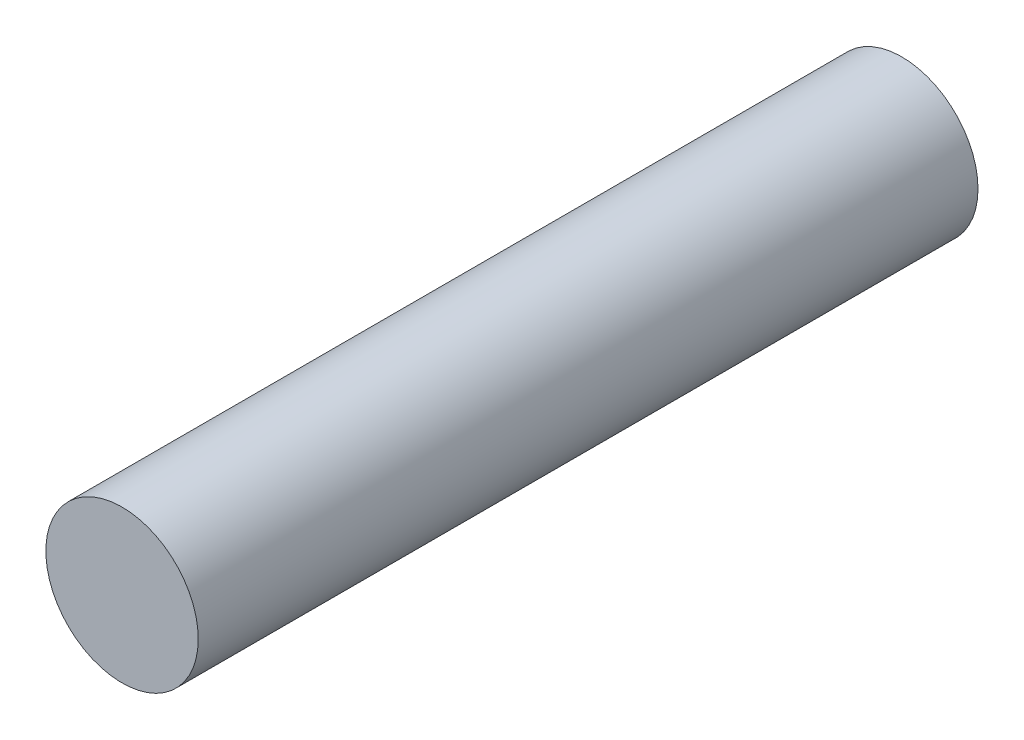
ISO-10303-21;
HEADER;
FILE_DESCRIPTION(('STEP AP214'),'2;1');
FILE_NAME('part.step','',(''),(''),'','','');
FILE_SCHEMA(('AUTOMOTIVE_DESIGN { 1 0 10303 214 1 1 1 1 }'));
ENDSEC;
DATA;
#1=APPLICATION_CONTEXT('core data for automotive mechanical design processes');
#2=APPLICATION_PROTOCOL_DEFINITION('international standard','automotive_design',2000,#1);
#3=PRODUCT_CONTEXT('',#1,'mechanical');
#4=PRODUCT('Part','Part','',(#3));
#5=PRODUCT_RELATED_PRODUCT_CATEGORY('part','',(#4));
#6=PRODUCT_DEFINITION_FORMATION('','',#4);
#7=PRODUCT_DEFINITION_CONTEXT('part definition',#1,'design');
#8=PRODUCT_DEFINITION('design','',#6,#7);
#9=PRODUCT_DEFINITION_SHAPE('','',#8);
#10=(LENGTH_UNIT() NAMED_UNIT(*) SI_UNIT(.MILLI.,.METRE.));
#11=(NAMED_UNIT(*) PLANE_ANGLE_UNIT() SI_UNIT($,.RADIAN.));
#12=(NAMED_UNIT(*) SI_UNIT($,.STERADIAN.) SOLID_ANGLE_UNIT());
#13=UNCERTAINTY_MEASURE_WITH_UNIT(LENGTH_MEASURE(1.E-05),#10,'distance_accuracy_value','');
#14=(GEOMETRIC_REPRESENTATION_CONTEXT(3) GLOBAL_UNCERTAINTY_ASSIGNED_CONTEXT((#13)) GLOBAL_UNIT_ASSIGNED_CONTEXT((#10,
#11,#12)) REPRESENTATION_CONTEXT('',''));
#15=CARTESIAN_POINT('',(0.,0.,0.));
#16=DIRECTION('',(0.,0.,1.));
#17=DIRECTION('',(1.,0.,0.));
#18=AXIS2_PLACEMENT_3D('',#15,#16,#17);
#19=CARTESIAN_POINT('',(0.,0.,30.7));
#20=DIRECTION('',(0.,0.,-1.));
#21=DIRECTION('',(-1.,0.,0.));
#22=AXIS2_PLACEMENT_3D('',#19,#20,#21);
#23=CYLINDRICAL_SURFACE('',#22,3.);
#24=CARTESIAN_POINT('',(0.,0.,30.7));
#25=DIRECTION('',(0.,0.,1.));
#26=DIRECTION('',(1.,0.,0.));
#27=AXIS2_PLACEMENT_3D('',#24,#25,#26);
#28=CIRCLE('',#27,3.);
#29=CARTESIAN_POINT('',(3.,0.,30.7));
#30=VERTEX_POINT('',#29);
#31=EDGE_CURVE('E10',#30,#30,#28,.T.);
#32=ORIENTED_EDGE('',*,*,#31,.F.);
#33=EDGE_LOOP('',(#32));
#34=FACE_BOUND('',#33,.T.);
#35=CARTESIAN_POINT('',(0.,0.,0.));
#36=DIRECTION('',(0.,0.,1.));
#37=DIRECTION('',(1.,0.,0.));
#38=AXIS2_PLACEMENT_3D('',#35,#36,#37);
#39=CIRCLE('',#38,3.);
#40=CARTESIAN_POINT('',(3.,0.,0.));
#41=VERTEX_POINT('',#40);
#42=EDGE_CURVE('E42',#41,#41,#39,.T.);
#43=ORIENTED_EDGE('',*,*,#42,.T.);
#44=EDGE_LOOP('',(#43));
#45=FACE_BOUND('',#44,.T.);
#46=ADVANCED_FACE('F39',(#34,#45),#23,.T.);
#47=CARTESIAN_POINT('',(0.,0.,30.7));
#48=DIRECTION('',(0.,0.,1.));
#49=DIRECTION('',(1.,0.,0.));
#50=AXIS2_PLACEMENT_3D('',#47,#48,#49);
#51=PLANE('',#50);
#52=ORIENTED_EDGE('',*,*,#31,.T.);
#53=EDGE_LOOP('',(#52));
#54=FACE_BOUND('',#53,.T.);
#55=ADVANCED_FACE('F54',(#54),#51,.T.);
#56=CARTESIAN_POINT('',(0.,0.,0.));
#57=DIRECTION('',(0.,0.,1.));
#58=DIRECTION('',(1.,0.,0.));
#59=AXIS2_PLACEMENT_3D('',#56,#57,#58);
#60=PLANE('',#59);
#61=ORIENTED_EDGE('',*,*,#42,.F.);
#62=EDGE_LOOP('',(#61));
#63=FACE_BOUND('',#62,.T.);
#64=ADVANCED_FACE('F52',(#63),#60,.F.);
#65=CLOSED_SHELL('',(#46,#55,#64));
#66=MANIFOLD_SOLID_BREP('B2',#65);
#67=ADVANCED_BREP_SHAPE_REPRESENTATION('',(#18,#66),#14);
#68=SHAPE_DEFINITION_REPRESENTATION(#9,#67);
ENDSEC;
END-ISO-10303-21;
